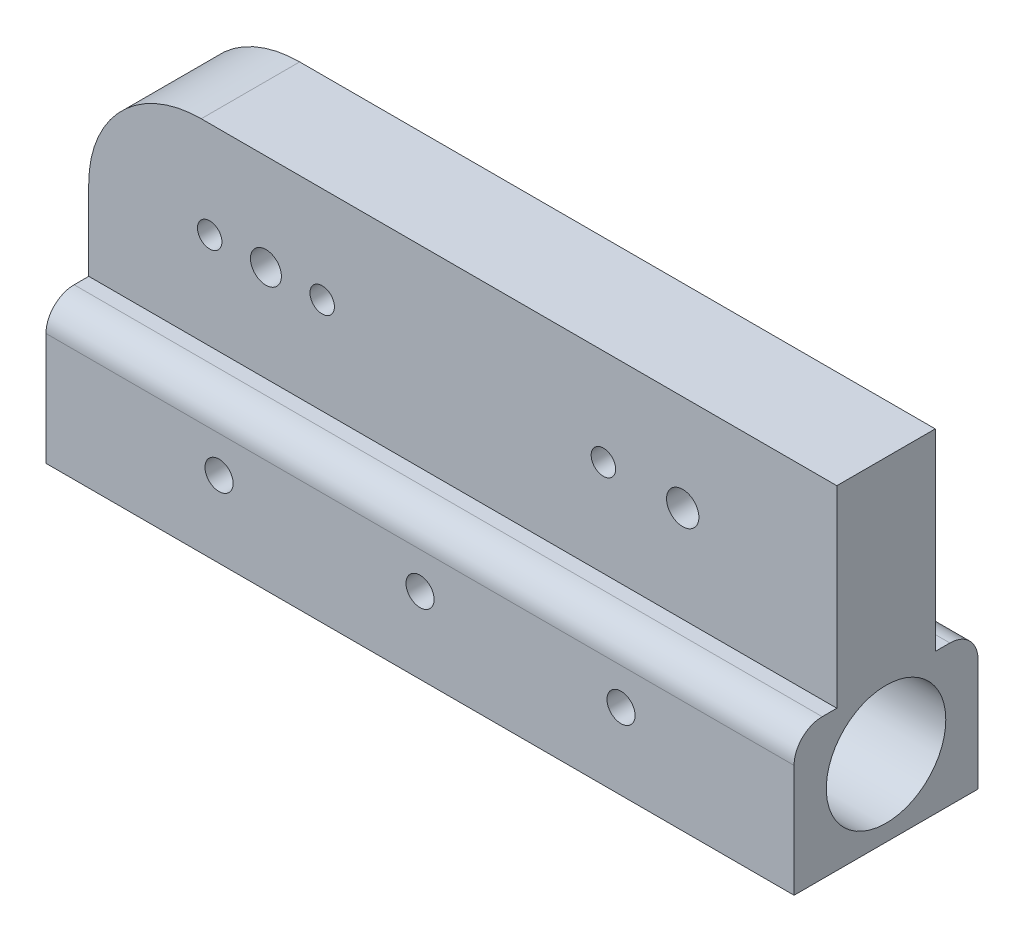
from build123d import *

# Parameters (mm, degrees)
SKETCH1_R           = 0.87
SKETCH1_R_2         = 1.1
SKETCH1_R_3         = 1.15
BOSS_EXTRUDE1_DEPTH = 7
SKETCH2_R           = 4
BOSS_EXTRUDE2_DEPTH = 53.201301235
SKETCH3_R           = 1
CUT_EXTRUDE2_DEPTH  = 6
SKETCH4_R           = 4.25
CUT_EXTRUDE3_DEPTH  = 73


with BuildPart() as part:
    # Sketch1 → Boss-Extrude1 (new body)
    with BuildSketch(Plane.XY):
        with BuildLine():
            Line((-9.12942044, 55.726954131), (44.071880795, 55.726954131))
            Line((44.071880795, 55.726954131), (44.071880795, 69.433402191))
            Line((44.071880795, 69.433402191), (-1.12942044, 69.433402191))
            ThreePointArc((-1.12942044, 69.433402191), (-6.78627469, 67.09025644), (-9.12942044, 61.433402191))
            Line((-9.12942044, 61.433402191), (-9.12942044, 55.726954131))
        make_face()
        with Locations((-0.528769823, 62.580178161)):
            Circle(SKETCH1_R, mode=Mode.SUBTRACT)
        with Locations((3.471230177, 62.580178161)):
            Circle(SKETCH1_R_2, mode=Mode.SUBTRACT)
        with Locations((7.471230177, 62.580178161)):
            Circle(SKETCH1_R, mode=Mode.SUBTRACT)
        with Locations((27.471230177, 62.580178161)):
            Circle(SKETCH1_R, mode=Mode.SUBTRACT)
        with Locations((33.111230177, 62.580178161)):
            Circle(SKETCH1_R_3, mode=Mode.SUBTRACT)
    extrude(amount=BOSS_EXTRUDE1_DEPTH)

    # Sketch2 → Boss-Extrude2 (add)
    with BuildSketch(Plane.ZY.offset(9.12942044)):
        with BuildLine():
            Line((-1.04, 55.726954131), (8.04, 55.726954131))
            ThreePointArc((8.04, 55.726954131), (9.454213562, 55.141167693), (10.04, 53.726954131))
            Line((10.04, 53.726954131), (10.04, 45.726954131))
            Line((10.04, 45.726954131), (-3.04, 45.726954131))
            Line((-3.04, 45.726954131), (-3.04, 53.726954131))
            ThreePointArc((-3.04, 53.726954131), (-2.454213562, 55.141167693), (-1.04, 55.726954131))
        make_face()
        with Locations((3.5, 51.143583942)):
            Circle(SKETCH2_R, mode=Mode.SUBTRACT)
    extrude(amount=-BOSS_EXTRUDE2_DEPTH)

    # Sketch3 → Cut-Extrude2 (cut)
    with BuildSketch(Plane.XY.offset(10.04)):
        with Locations((3.177791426, 51.143583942)):
            Circle(SKETCH3_R)
        with Locations((17.471230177, 51.143583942)):
            Circle(SKETCH3_R)
        with Locations(Location((31.764668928, 51.143583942, 0), (0, 0, 180))):
            Circle(SKETCH3_R)
    extrude(amount=-CUT_EXTRUDE2_DEPTH, mode=Mode.SUBTRACT)

    # Sketch4 → Cut-Extrude3 (cut)
    with BuildSketch(Plane(origin=(44.071880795, 0, 0), x_dir=(0, 0, -1), z_dir=(1, 0, 0))):
        with Locations((-3.5, 51.143583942)):
            Circle(SKETCH4_R)
    extrude(amount=-CUT_EXTRUDE3_DEPTH, mode=Mode.SUBTRACT)


solid = part.part
